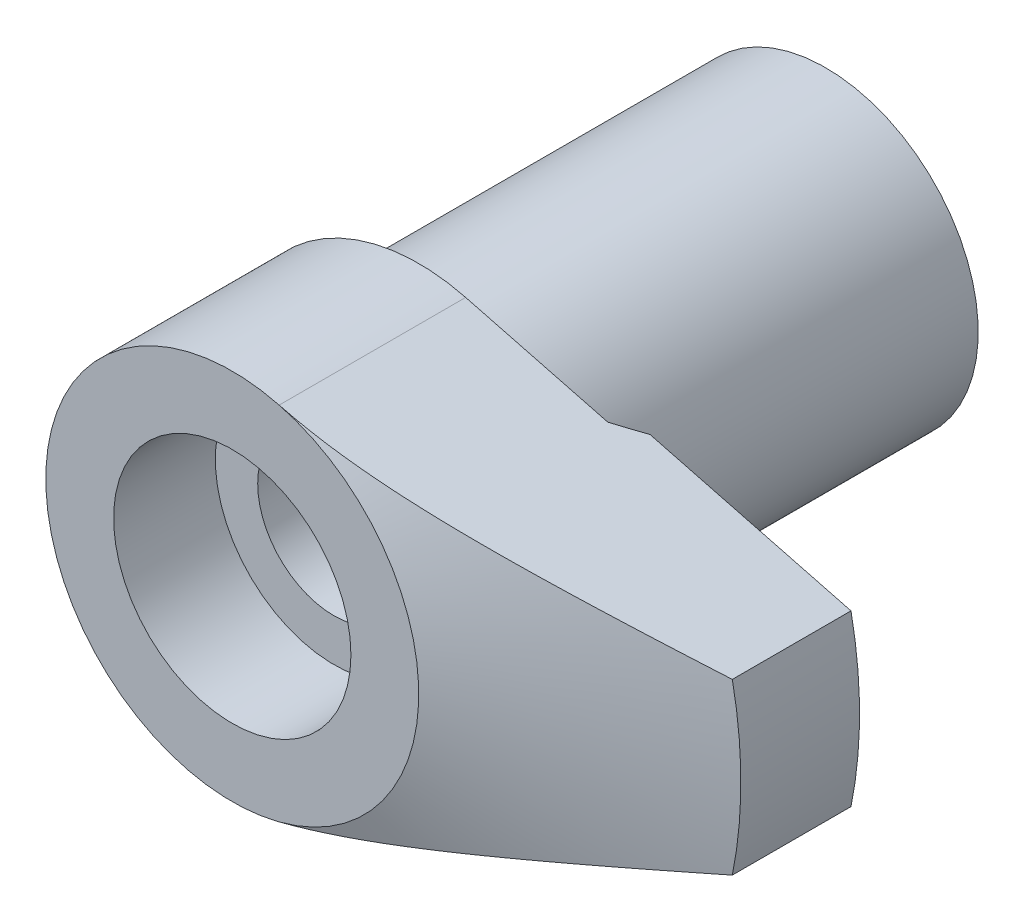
ISO-10303-21;
HEADER;
FILE_DESCRIPTION(('STEP AP214'),'2;1');
FILE_NAME('part.step','',(''),(''),'','','');
FILE_SCHEMA(('AUTOMOTIVE_DESIGN { 1 0 10303 214 1 1 1 1 }'));
ENDSEC;
DATA;
#1=APPLICATION_CONTEXT('core data for automotive mechanical design processes');
#2=APPLICATION_PROTOCOL_DEFINITION('international standard','automotive_design',2000,#1);
#3=PRODUCT_CONTEXT('',#1,'mechanical');
#4=PRODUCT('Part','Part','',(#3));
#5=PRODUCT_RELATED_PRODUCT_CATEGORY('part','',(#4));
#6=PRODUCT_DEFINITION_FORMATION('','',#4);
#7=PRODUCT_DEFINITION_CONTEXT('part definition',#1,'design');
#8=PRODUCT_DEFINITION('design','',#6,#7);
#9=PRODUCT_DEFINITION_SHAPE('','',#8);
#10=(LENGTH_UNIT() NAMED_UNIT(*) SI_UNIT(.MILLI.,.METRE.));
#11=(NAMED_UNIT(*) PLANE_ANGLE_UNIT() SI_UNIT($,.RADIAN.));
#12=(NAMED_UNIT(*) SI_UNIT($,.STERADIAN.) SOLID_ANGLE_UNIT());
#13=UNCERTAINTY_MEASURE_WITH_UNIT(LENGTH_MEASURE(1.E-05),#10,'distance_accuracy_value','');
#14=(GEOMETRIC_REPRESENTATION_CONTEXT(3) GLOBAL_UNCERTAINTY_ASSIGNED_CONTEXT((#13)) GLOBAL_UNIT_ASSIGNED_CONTEXT((#10,
#11,#12)) REPRESENTATION_CONTEXT('',''));
#15=CARTESIAN_POINT('',(0.,0.,0.));
#16=DIRECTION('',(0.,0.,1.));
#17=DIRECTION('',(1.,0.,0.));
#18=AXIS2_PLACEMENT_3D('',#15,#16,#17);
#19=CARTESIAN_POINT('',(24.4948974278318,5.,35.));
#20=DIRECTION('',(-0.25151064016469,-0.967854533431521,0.));
#21=DIRECTION('',(0.967854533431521,-0.25151064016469,0.));
#22=AXIS2_PLACEMENT_3D('',#19,#20,#21);
#23=PLANE('',#22);
#24=DIRECTION('',(0.967854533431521,-0.25151064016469,0.));
#25=VECTOR('',#24,1.);
#26=CARTESIAN_POINT('',(2.76661704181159,10.6463998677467,24.));
#27=LINE('',#26,#25);
#28=CARTESIAN_POINT('',(2.76661704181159,10.6463998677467,24.));
#29=VERTEX_POINT('',#28);
#30=CARTESIAN_POINT('',(11.1484831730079,8.46825383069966,24.));
#31=VERTEX_POINT('',#30);
#32=EDGE_CURVE('E71',#29,#31,#27,.T.);
#33=ORIENTED_EDGE('',*,*,#32,.F.);
#34=DIRECTION('',(0.,0.,-1.));
#35=VECTOR('',#34,1.);
#36=CARTESIAN_POINT('',(2.76661704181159,10.6463998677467,35.));
#37=LINE('',#36,#35);
#38=CARTESIAN_POINT('',(2.76661704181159,10.6463998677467,35.));
#39=VERTEX_POINT('',#38);
#40=EDGE_CURVE('E83',#39,#29,#37,.T.);
#41=ORIENTED_EDGE('',*,*,#40,.F.);
#42=CARTESIAN_POINT('',(24.4950974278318,4.99994802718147,29.9999337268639));
#43=CARTESIAN_POINT('',(24.0522116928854,5.11503812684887,30.1466796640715));
#44=CARTESIAN_POINT('',(23.6090863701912,5.23019048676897,30.2926581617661));
#45=CARTESIAN_POINT('',(22.7222658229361,5.46064330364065,30.5827713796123));
#46=CARTESIAN_POINT('',(22.2785705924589,5.57594376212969,30.7269060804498));
#47=CARTESIAN_POINT('',(21.3906147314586,5.80669160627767,31.0129920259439));
#48=CARTESIAN_POINT('',(20.9463542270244,5.92213895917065,31.1549436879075));
#49=CARTESIAN_POINT('',(20.0570760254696,6.15323043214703,31.4362914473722));
#50=CARTESIAN_POINT('',(19.6120583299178,6.26887455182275,31.5756875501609));
#51=CARTESIAN_POINT('',(18.7232977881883,6.49983150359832,31.8507651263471));
#52=CARTESIAN_POINT('',(18.2795592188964,6.61514322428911,31.9864613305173));
#53=CARTESIAN_POINT('',(17.3910601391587,6.84603223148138,32.2542320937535));
#54=CARTESIAN_POINT('',(16.94629963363,6.96160951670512,32.3863066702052));
#55=CARTESIAN_POINT('',(16.0554166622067,7.1931180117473,32.6461271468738));
#56=CARTESIAN_POINT('',(15.6092937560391,7.30904933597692,32.7738714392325));
#57=CARTESIAN_POINT('',(14.7156449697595,7.54127656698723,33.0240315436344));
#58=CARTESIAN_POINT('',(14.2681190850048,7.65757247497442,33.1464473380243));
#59=CARTESIAN_POINT('',(13.3686258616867,7.89131846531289,33.3855064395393));
#60=CARTESIAN_POINT('',(12.9166482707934,8.0087712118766,33.5021087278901));
#61=CARTESIAN_POINT('',(12.0107954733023,8.2441698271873,33.7271951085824));
#62=CARTESIAN_POINT('',(11.5569202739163,8.3621156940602,33.8356792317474));
#63=CARTESIAN_POINT('',(10.6474365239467,8.59845786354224,34.0425667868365));
#64=CARTESIAN_POINT('',(10.1918298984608,8.71685366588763,34.1409791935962));
#65=CARTESIAN_POINT('',(9.27826891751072,8.954255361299,34.3255960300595));
#66=CARTESIAN_POINT('',(8.82031448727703,9.07326127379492,34.4118000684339));
#67=CARTESIAN_POINT('',(7.8996808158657,9.31250090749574,34.5698254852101));
#68=CARTESIAN_POINT('',(7.4369893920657,9.43273779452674,34.641571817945));
#69=CARTESIAN_POINT('',(6.50937566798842,9.67379129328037,34.7673452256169));
#70=CARTESIAN_POINT('',(6.04445370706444,9.79460781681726,34.8213749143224));
#71=CARTESIAN_POINT('',(5.34500310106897,9.97636991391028,34.8872915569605));
#72=CARTESIAN_POINT('',(5.11113046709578,10.0371450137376,34.9067615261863));
#73=CARTESIAN_POINT('',(4.64302336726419,10.1587892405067,34.9403487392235));
#74=CARTESIAN_POINT('',(4.40878890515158,10.2196583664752,34.9544660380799));
#75=CARTESIAN_POINT('',(3.93993571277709,10.341496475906,34.9771441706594));
#76=CARTESIAN_POINT('',(3.70531684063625,10.4024654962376,34.9857018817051));
#77=CARTESIAN_POINT('',(3.23593856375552,10.5244400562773,34.997138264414));
#78=CARTESIAN_POINT('',(3.00117915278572,10.5854455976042,35.000016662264));
#79=CARTESIAN_POINT('',(2.76641704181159,10.6464518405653,34.9999999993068));
#80=B_SPLINE_CURVE_WITH_KNOTS('',3,(#42,#43,#44,#45,#46,#47,#48,#49,#50,#51,#52,#53,#54,#55,#56,
#57,#58,#59,#60,#61,#62,#63,#64,#65,#66,#67,#68,#69,#70,#71,#72,#73,#74,#75,#76,#77,#78,#79),
.UNSPECIFIED.,.F.,.F.,(4,2,2,2,2,2,2,2,2,2,2,2,2,2,2,2,2,2,4),(0.,1.44165002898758,
2.88331514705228,4.32470116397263,5.76608419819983,7.20048032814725,8.6348695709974,
10.0697857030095,11.5047065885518,12.9486269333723,14.3925417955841,15.8351585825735,
17.277821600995,18.7277903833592,20.1775451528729,20.9047655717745,21.631978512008,
22.3595995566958,23.0872556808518),.UNSPECIFIED.);
#81=CARTESIAN_POINT('',(24.4948974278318,5.,30.));
#82=VERTEX_POINT('',#81);
#83=EDGE_CURVE('E123',#82,#39,#80,.T.);
#84=ORIENTED_EDGE('',*,*,#83,.F.);
#85=DIRECTION('',(0.,0.,-1.));
#86=VECTOR('',#85,1.);
#87=CARTESIAN_POINT('',(24.4948974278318,5.,35.));
#88=LINE('',#87,#86);
#89=CARTESIAN_POINT('',(24.4948974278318,5.,23.));
#90=VERTEX_POINT('',#89);
#91=EDGE_CURVE('E89',#82,#90,#88,.T.);
#92=ORIENTED_EDGE('',*,*,#91,.T.);
#93=DIRECTION('',(-0.967854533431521,0.25151064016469,0.));
#94=VECTOR('',#93,1.);
#95=CARTESIAN_POINT('',(24.4948974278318,5.,23.));
#96=LINE('',#95,#94);
#97=CARTESIAN_POINT('',(12.6368353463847,8.08148454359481,23.));
#98=VERTEX_POINT('',#97);
#99=EDGE_CURVE('E135',#90,#98,#96,.T.);
#100=ORIENTED_EDGE('',*,*,#99,.T.);
#101=CARTESIAN_POINT('',(26.2382325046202,4.54696981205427,11.3706969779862));
#102=CARTESIAN_POINT('',(25.8991823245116,4.63507677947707,11.6897147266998));
#103=CARTESIAN_POINT('',(25.5595716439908,4.72332940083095,12.0080978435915));
#104=CARTESIAN_POINT('',(24.8790691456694,4.90016756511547,12.6434048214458));
#105=CARTESIAN_POINT('',(24.5381773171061,4.98875311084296,12.9603286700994));
#106=CARTESIAN_POINT('',(23.8548820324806,5.16631702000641,13.5925921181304));
#107=CARTESIAN_POINT('',(23.5124782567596,5.25529546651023,13.9079313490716));
#108=CARTESIAN_POINT('',(22.8260407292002,5.43367593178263,14.5367066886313));
#109=CARTESIAN_POINT('',(22.4820069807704,5.52307794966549,14.8501428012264));
#110=CARTESIAN_POINT('',(21.443461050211,5.79295874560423,15.790528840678));
#111=CARTESIAN_POINT('',(20.7461385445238,5.97416782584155,16.4141836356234));
#112=CARTESIAN_POINT('',(19.6928188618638,6.24788778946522,17.3406851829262));
#113=CARTESIAN_POINT('',(19.3405068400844,6.33944103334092,17.6480076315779));
#114=CARTESIAN_POINT('',(18.6330196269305,6.52329155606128,18.2591176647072));
#115=CARTESIAN_POINT('',(18.2778444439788,6.61558883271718,18.562905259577));
#116=CARTESIAN_POINT('',(17.6243853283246,6.78539939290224,19.1153607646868));
#117=CARTESIAN_POINT('',(17.3266162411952,6.86277888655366,19.3646784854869));
#118=CARTESIAN_POINT('',(16.7284511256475,7.01822052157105,19.859925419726));
#119=CARTESIAN_POINT('',(16.428055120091,7.09628265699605,20.1058546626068));
#120=CARTESIAN_POINT('',(15.8241820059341,7.25320759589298,20.5937959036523));
#121=CARTESIAN_POINT('',(15.5207042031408,7.3320705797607,20.8358069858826));
#122=CARTESIAN_POINT('',(14.910279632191,7.49069800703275,21.3151273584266));
#123=CARTESIAN_POINT('',(14.6033328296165,7.57046245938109,21.5524366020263));
#124=CARTESIAN_POINT('',(13.985611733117,7.73098599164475,22.0213074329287));
#125=CARTESIAN_POINT('',(13.6748396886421,7.81174448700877,22.2528721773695));
#126=CARTESIAN_POINT('',(13.0486773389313,7.97446159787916,22.709237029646));
#127=CARTESIAN_POINT('',(12.7332871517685,8.05642018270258,22.9340373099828));
#128=CARTESIAN_POINT('',(12.0972918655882,8.22169252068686,23.3753142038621));
#129=CARTESIAN_POINT('',(11.7766892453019,8.30500562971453,23.5917946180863));
#130=CARTESIAN_POINT('',(11.129246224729,8.47325282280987,24.0146878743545));
#131=CARTESIAN_POINT('',(10.8024050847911,8.55818709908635,24.2210995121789));
#132=CARTESIAN_POINT('',(10.117911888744,8.73606230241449,24.6357554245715));
#133=CARTESIAN_POINT('',(9.75972979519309,8.82914096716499,24.8430719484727));
#134=CARTESIAN_POINT('',(9.03406791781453,9.01771443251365,25.2394227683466));
#135=CARTESIAN_POINT('',(8.66659090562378,9.1132085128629,25.4284624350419));
#136=CARTESIAN_POINT('',(7.9216536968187,9.30679094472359,25.7831080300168));
#137=CARTESIAN_POINT('',(7.54420676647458,9.40487584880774,25.9487434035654));
#138=CARTESIAN_POINT('',(6.77840319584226,9.60388069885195,26.2506267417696));
#139=CARTESIAN_POINT('',(6.39005017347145,9.70479970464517,26.3868843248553));
#140=CARTESIAN_POINT('',(5.6895052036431,9.88684618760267,26.5970144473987));
#141=CARTESIAN_POINT('',(5.37932687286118,9.96745039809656,26.6780161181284));
#142=CARTESIAN_POINT('',(4.75371765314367,10.1300237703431,26.814494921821));
#143=CARTESIAN_POINT('',(4.43828751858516,10.2119927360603,26.8699756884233));
#144=CARTESIAN_POINT('',(3.80502546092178,10.376554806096,26.9525470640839));
#145=CARTESIAN_POINT('',(3.48720563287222,10.4591447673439,26.9797352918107));
#146=CARTESIAN_POINT('',(2.85047359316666,10.6246085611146,27.0045695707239));
#147=CARTESIAN_POINT('',(2.53156140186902,10.7074823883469,27.0022161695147));
#148=CARTESIAN_POINT('',(1.89635384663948,10.8725500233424,26.9681621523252));
#149=CARTESIAN_POINT('',(1.58005322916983,10.9547451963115,26.9365643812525));
#150=CARTESIAN_POINT('',(0.951191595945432,11.118163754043,26.8458635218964));
#151=CARTESIAN_POINT('',(0.638630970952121,11.1993870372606,26.7867575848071));
#152=CARTESIAN_POINT('',(0.0158552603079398,11.3612240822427,26.6431401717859));
#153=CARTESIAN_POINT('',(-0.294306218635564,11.4418239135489,26.5583836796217));
#154=CARTESIAN_POINT('',(-0.908154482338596,11.6013410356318,26.3670987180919));
#155=CARTESIAN_POINT('',(-1.21184206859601,11.6802585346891,26.2605729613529));
#156=CARTESIAN_POINT('',(-1.85174828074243,11.8465471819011,26.0140240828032));
#157=CARTESIAN_POINT('',(-2.18703716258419,11.9336767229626,25.8714433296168));
#158=CARTESIAN_POINT('',(-2.84944117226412,12.1058117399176,25.5671414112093));
#159=CARTESIAN_POINT('',(-3.17655313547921,12.1908163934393,25.4054129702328));
#160=CARTESIAN_POINT('',(-3.82402043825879,12.3590698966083,25.0660746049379));
#161=CARTESIAN_POINT('',(-4.14435525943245,12.4423134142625,24.8884231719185));
#162=CARTESIAN_POINT('',(-4.77813236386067,12.6070093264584,24.5206130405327));
#163=CARTESIAN_POINT('',(-5.09157553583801,12.6884619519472,24.3304559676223));
#164=CARTESIAN_POINT('',(-5.70078766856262,12.84677431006,23.9472912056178));
#165=CARTESIAN_POINT('',(-5.99677846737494,12.9236916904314,23.7546583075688));
#166=CARTESIAN_POINT('',(-6.58388700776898,13.0762601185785,23.3615982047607));
#167=CARTESIAN_POINT('',(-6.87500440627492,13.1519110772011,23.1611704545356));
#168=CARTESIAN_POINT('',(-7.45101169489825,13.3015946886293,22.7552342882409));
#169=CARTESIAN_POINT('',(-7.73593036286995,13.3756348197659,22.5497693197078));
#170=CARTESIAN_POINT('',(-8.30199242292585,13.522734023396,22.1335064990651));
#171=CARTESIAN_POINT('',(-8.58313673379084,13.5957933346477,21.9227099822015));
#172=CARTESIAN_POINT('',(-8.86268598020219,13.6684381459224,21.7097144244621));
#173=B_SPLINE_CURVE_WITH_KNOTS('',3,(#101,#102,#103,#104,#105,#106,#107,#108,#109,#110,#111,
#112,#113,#114,#115,#116,#117,#118,#119,#120,#121,#122,#123,#124,#125,#126,#127,#128,#129,#130,
#131,#132,#133,#134,#135,#136,#137,#138,#139,#140,#141,#142,#143,#144,#145,#146,#147,#148,#149,
#150,#151,#152,#153,#154,#155,#156,#157,#158,#159,#160,#161,#162,#163,#164,#165,#166,#167,#168,
#169,#170,#171,#172),.UNSPECIFIED.,.F.,.F.,(4,2,2,2,2,2,2,2,2,2,2,2,2,2,2,2,2,2,2,2,2,2,2,2,2,2,
2,2,2,2,2,2,2,2,2,4),(0.,1.42141224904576,2.84283646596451,4.26457715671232,5.68631487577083,
8.54493189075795,9.97410235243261,11.4032686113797,12.5912386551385,13.7791983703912,
14.9674318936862,16.1556772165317,17.3432543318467,18.5308011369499,19.7177988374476,
20.9049381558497,22.1771102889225,23.448907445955,24.7190900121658,25.9888560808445,
26.9796391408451,27.9702810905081,28.9574935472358,29.9446877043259,30.9284232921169,
31.9122607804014,32.9058096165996,33.8992347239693,35.022369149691,36.1459317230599,
37.2725135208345,38.398949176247,39.483111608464,40.5673500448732,41.6442669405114,
42.7209167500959),.UNSPECIFIED.);
#174=EDGE_CURVE('E29',#98,#31,#173,.T.);
#175=ORIENTED_EDGE('',*,*,#174,.T.);
#176=EDGE_LOOP('',(#33,#41,#84,#92,#100,#175));
#177=FACE_BOUND('',#176,.T.);
#178=ADVANCED_FACE('F14',(#177),#23,.F.);
#179=CARTESIAN_POINT('',(24.4948974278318,-5.,35.));
#180=DIRECTION('',(0.25151064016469,-0.967854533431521,0.));
#181=DIRECTION('',(0.967854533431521,0.25151064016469,0.));
#182=AXIS2_PLACEMENT_3D('',#179,#180,#181);
#183=PLANE('',#182);
#184=DIRECTION('',(0.,0.,-1.));
#185=VECTOR('',#184,1.);
#186=CARTESIAN_POINT('',(2.76661704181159,-10.6463998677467,35.));
#187=LINE('',#186,#185);
#188=CARTESIAN_POINT('',(2.76661704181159,-10.6463998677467,35.));
#189=VERTEX_POINT('',#188);
#190=CARTESIAN_POINT('',(2.76661704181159,-10.6463998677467,24.));
#191=VERTEX_POINT('',#190);
#192=EDGE_CURVE('E90',#189,#191,#187,.T.);
#193=ORIENTED_EDGE('',*,*,#192,.T.);
#194=DIRECTION('',(-0.967854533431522,-0.251510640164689,0.));
#195=VECTOR('',#194,1.);
#196=CARTESIAN_POINT('',(11.1484831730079,-8.46825383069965,24.));
#197=LINE('',#196,#195);
#198=CARTESIAN_POINT('',(11.1484831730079,-8.46825383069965,24.));
#199=VERTEX_POINT('',#198);
#200=EDGE_CURVE('E73',#199,#191,#197,.T.);
#201=ORIENTED_EDGE('',*,*,#200,.F.);
#202=CARTESIAN_POINT('',(26.2382325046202,-4.54696981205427,11.3706969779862));
#203=CARTESIAN_POINT('',(25.8991823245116,-4.63507677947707,11.6897147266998));
#204=CARTESIAN_POINT('',(25.5595716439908,-4.72332940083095,12.0080978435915));
#205=CARTESIAN_POINT('',(24.8790691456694,-4.90016756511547,12.6434048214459));
#206=CARTESIAN_POINT('',(24.5381773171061,-4.98875311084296,12.9603286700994));
#207=CARTESIAN_POINT('',(23.8548820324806,-5.16631702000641,13.5925921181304));
#208=CARTESIAN_POINT('',(23.5124782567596,-5.25529546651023,13.9079313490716));
#209=CARTESIAN_POINT('',(22.8260407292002,-5.43367593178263,14.5367066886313));
#210=CARTESIAN_POINT('',(22.4820069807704,-5.52307794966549,14.8501428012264));
#211=CARTESIAN_POINT('',(21.443461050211,-5.79295874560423,15.790528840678));
#212=CARTESIAN_POINT('',(20.7461385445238,-5.97416782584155,16.4141836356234));
#213=CARTESIAN_POINT('',(19.6928188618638,-6.24788778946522,17.3406851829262));
#214=CARTESIAN_POINT('',(19.3405068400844,-6.33944103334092,17.6480076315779));
#215=CARTESIAN_POINT('',(18.6330196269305,-6.52329155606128,18.2591176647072));
#216=CARTESIAN_POINT('',(18.2778444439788,-6.61558883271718,18.562905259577));
#217=CARTESIAN_POINT('',(17.6243853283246,-6.78539939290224,19.1153607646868));
#218=CARTESIAN_POINT('',(17.3266162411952,-6.86277888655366,19.3646784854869));
#219=CARTESIAN_POINT('',(16.7284511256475,-7.01822052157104,19.859925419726));
#220=CARTESIAN_POINT('',(16.428055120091,-7.09628265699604,20.1058546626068));
#221=CARTESIAN_POINT('',(15.8241820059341,-7.25320759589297,20.5937959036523));
#222=CARTESIAN_POINT('',(15.5207042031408,-7.33207057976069,20.8358069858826));
#223=CARTESIAN_POINT('',(14.910279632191,-7.49069800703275,21.3151273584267));
#224=CARTESIAN_POINT('',(14.6033328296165,-7.57046245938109,21.5524366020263));
#225=CARTESIAN_POINT('',(13.985611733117,-7.73098599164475,22.0213074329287));
#226=CARTESIAN_POINT('',(13.6748396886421,-7.81174448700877,22.2528721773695));
#227=CARTESIAN_POINT('',(13.0486773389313,-7.97446159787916,22.709237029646));
#228=CARTESIAN_POINT('',(12.7332871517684,-8.05642018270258,22.9340373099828));
#229=CARTESIAN_POINT('',(12.0972918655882,-8.22169252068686,23.3753142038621));
#230=CARTESIAN_POINT('',(11.7766892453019,-8.30500562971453,23.5917946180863));
#231=CARTESIAN_POINT('',(11.1292462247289,-8.47325282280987,24.0146878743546));
#232=CARTESIAN_POINT('',(10.8024050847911,-8.55818709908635,24.2210995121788));
#233=CARTESIAN_POINT('',(10.117911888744,-8.73606230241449,24.6357554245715));
#234=CARTESIAN_POINT('',(9.75972979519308,-8.82914096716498,24.8430719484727));
#235=CARTESIAN_POINT('',(9.03406791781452,-9.01771443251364,25.2394227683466));
#236=CARTESIAN_POINT('',(8.66659090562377,-9.1132085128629,25.4284624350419));
#237=CARTESIAN_POINT('',(7.9216536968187,-9.30679094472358,25.7831080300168));
#238=CARTESIAN_POINT('',(7.54420676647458,-9.40487584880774,25.9487434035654));
#239=CARTESIAN_POINT('',(6.77840319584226,-9.60388069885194,26.2506267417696));
#240=CARTESIAN_POINT('',(6.39005017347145,-9.70479970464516,26.3868843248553));
#241=CARTESIAN_POINT('',(5.6895052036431,-9.88684618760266,26.5970144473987));
#242=CARTESIAN_POINT('',(5.37932687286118,-9.96745039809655,26.6780161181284));
#243=CARTESIAN_POINT('',(4.75371765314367,-10.1300237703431,26.814494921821));
#244=CARTESIAN_POINT('',(4.43828751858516,-10.2119927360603,26.8699756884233));
#245=CARTESIAN_POINT('',(3.80502546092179,-10.376554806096,26.952547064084));
#246=CARTESIAN_POINT('',(3.48720563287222,-10.4591447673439,26.9797352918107));
#247=CARTESIAN_POINT('',(2.85047359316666,-10.6246085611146,27.0045695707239));
#248=CARTESIAN_POINT('',(2.53156140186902,-10.7074823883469,27.0022161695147));
#249=CARTESIAN_POINT('',(1.89635384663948,-10.8725500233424,26.9681621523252));
#250=CARTESIAN_POINT('',(1.58005322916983,-10.9547451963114,26.9365643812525));
#251=CARTESIAN_POINT('',(0.951191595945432,-11.118163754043,26.8458635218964));
#252=CARTESIAN_POINT('',(0.638630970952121,-11.1993870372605,26.7867575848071));
#253=CARTESIAN_POINT('',(0.0158552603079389,-11.3612240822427,26.6431401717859));
#254=CARTESIAN_POINT('',(-0.294306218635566,-11.4418239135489,26.5583836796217));
#255=CARTESIAN_POINT('',(-0.908154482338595,-11.6013410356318,26.3670987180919));
#256=CARTESIAN_POINT('',(-1.211842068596,-11.6802585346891,26.2605729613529));
#257=CARTESIAN_POINT('',(-1.85174828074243,-11.8465471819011,26.0140240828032));
#258=CARTESIAN_POINT('',(-2.18703716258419,-11.9336767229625,25.8714433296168));
#259=CARTESIAN_POINT('',(-2.84944117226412,-12.1058117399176,25.5671414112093));
#260=CARTESIAN_POINT('',(-3.17655313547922,-12.1908163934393,25.4054129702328));
#261=CARTESIAN_POINT('',(-3.8240204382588,-12.3590698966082,25.0660746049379));
#262=CARTESIAN_POINT('',(-4.14435525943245,-12.4423134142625,24.8884231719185));
#263=CARTESIAN_POINT('',(-4.77813236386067,-12.6070093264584,24.5206130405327));
#264=CARTESIAN_POINT('',(-5.09157553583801,-12.6884619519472,24.3304559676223));
#265=CARTESIAN_POINT('',(-5.70078766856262,-12.84677431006,23.9472912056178));
#266=CARTESIAN_POINT('',(-5.99677846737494,-12.9236916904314,23.7546583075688));
#267=CARTESIAN_POINT('',(-6.58388700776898,-13.0762601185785,23.3615982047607));
#268=CARTESIAN_POINT('',(-6.87500440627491,-13.151911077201,23.1611704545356));
#269=CARTESIAN_POINT('',(-7.45101169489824,-13.3015946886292,22.7552342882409));
#270=CARTESIAN_POINT('',(-7.73593036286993,-13.3756348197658,22.5497693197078));
#271=CARTESIAN_POINT('',(-8.30199242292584,-13.522734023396,22.1335064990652));
#272=CARTESIAN_POINT('',(-8.58313673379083,-13.5957933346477,21.9227099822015));
#273=CARTESIAN_POINT('',(-8.86268598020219,-13.6684381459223,21.7097144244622));
#274=B_SPLINE_CURVE_WITH_KNOTS('',3,(#202,#203,#204,#205,#206,#207,#208,#209,#210,#211,#212,
#213,#214,#215,#216,#217,#218,#219,#220,#221,#222,#223,#224,#225,#226,#227,#228,#229,#230,#231,
#232,#233,#234,#235,#236,#237,#238,#239,#240,#241,#242,#243,#244,#245,#246,#247,#248,#249,#250,
#251,#252,#253,#254,#255,#256,#257,#258,#259,#260,#261,#262,#263,#264,#265,#266,#267,#268,#269,
#270,#271,#272,#273),.UNSPECIFIED.,.F.,.F.,(4,2,2,2,2,2,2,2,2,2,2,2,2,2,2,2,2,2,2,2,2,2,2,2,2,2,
2,2,2,2,2,2,2,2,2,4),(0.,1.42141224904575,2.8428364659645,4.26457715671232,5.68631487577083,
8.54493189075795,9.9741023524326,11.4032686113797,12.5912386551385,13.7791983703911,
14.9674318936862,16.1556772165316,17.3432543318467,18.5308011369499,19.7177988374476,
20.9049381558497,22.1771102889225,23.448907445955,24.7190900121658,25.9888560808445,
26.9796391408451,27.9702810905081,28.9574935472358,29.9446877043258,30.9284232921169,
31.9122607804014,32.9058096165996,33.8992347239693,35.022369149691,36.1459317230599,
37.2725135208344,38.3989491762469,39.483111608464,40.5673500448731,41.6442669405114,
42.7209167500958),.UNSPECIFIED.);
#275=CARTESIAN_POINT('',(12.6368353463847,-8.0814845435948,23.));
#276=VERTEX_POINT('',#275);
#277=EDGE_CURVE('E148',#276,#199,#274,.T.);
#278=ORIENTED_EDGE('',*,*,#277,.F.);
#279=DIRECTION('',(-0.967854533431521,-0.25151064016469,0.));
#280=VECTOR('',#279,1.);
#281=CARTESIAN_POINT('',(24.4948974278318,-5.,23.));
#282=LINE('',#281,#280);
#283=CARTESIAN_POINT('',(24.4948974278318,-5.,23.));
#284=VERTEX_POINT('',#283);
#285=EDGE_CURVE('E92',#284,#276,#282,.T.);
#286=ORIENTED_EDGE('',*,*,#285,.F.);
#287=DIRECTION('',(0.,0.,-1.));
#288=VECTOR('',#287,1.);
#289=CARTESIAN_POINT('',(24.4948974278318,-5.,35.));
#290=LINE('',#289,#288);
#291=CARTESIAN_POINT('',(24.4948974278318,-5.,30.));
#292=VERTEX_POINT('',#291);
#293=EDGE_CURVE('E36',#292,#284,#290,.T.);
#294=ORIENTED_EDGE('',*,*,#293,.F.);
#295=CARTESIAN_POINT('',(24.4950974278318,-4.99994802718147,29.9999337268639));
#296=CARTESIAN_POINT('',(24.0522116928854,-5.11503812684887,30.1466796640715));
#297=CARTESIAN_POINT('',(23.6090863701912,-5.23019048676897,30.2926581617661));
#298=CARTESIAN_POINT('',(22.7222658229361,-5.46064330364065,30.5827713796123));
#299=CARTESIAN_POINT('',(22.2785705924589,-5.57594376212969,30.7269060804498));
#300=CARTESIAN_POINT('',(21.3906147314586,-5.80669160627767,31.0129920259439));
#301=CARTESIAN_POINT('',(20.9463542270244,-5.92213895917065,31.1549436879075));
#302=CARTESIAN_POINT('',(20.0570760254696,-6.15323043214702,31.4362914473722));
#303=CARTESIAN_POINT('',(19.6120583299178,-6.26887455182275,31.5756875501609));
#304=CARTESIAN_POINT('',(18.7232977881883,-6.49983150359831,31.8507651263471));
#305=CARTESIAN_POINT('',(18.2795592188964,-6.6151432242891,31.9864613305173));
#306=CARTESIAN_POINT('',(17.3910601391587,-6.84603223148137,32.2542320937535));
#307=CARTESIAN_POINT('',(16.94629963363,-6.96160951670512,32.3863066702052));
#308=CARTESIAN_POINT('',(16.0554166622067,-7.1931180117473,32.6461271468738));
#309=CARTESIAN_POINT('',(15.6092937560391,-7.30904933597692,32.7738714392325));
#310=CARTESIAN_POINT('',(14.7156449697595,-7.54127656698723,33.0240315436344));
#311=CARTESIAN_POINT('',(14.2681190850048,-7.65757247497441,33.1464473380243));
#312=CARTESIAN_POINT('',(13.3686258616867,-7.89131846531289,33.3855064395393));
#313=CARTESIAN_POINT('',(12.9166482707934,-8.0087712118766,33.5021087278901));
#314=CARTESIAN_POINT('',(12.0107954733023,-8.2441698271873,33.7271951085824));
#315=CARTESIAN_POINT('',(11.5569202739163,-8.3621156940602,33.8356792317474));
#316=CARTESIAN_POINT('',(10.6474365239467,-8.59845786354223,34.0425667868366));
#317=CARTESIAN_POINT('',(10.1918298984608,-8.71685366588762,34.1409791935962));
#318=CARTESIAN_POINT('',(9.27826891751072,-8.954255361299,34.3255960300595));
#319=CARTESIAN_POINT('',(8.82031448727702,-9.07326127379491,34.4118000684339));
#320=CARTESIAN_POINT('',(7.8996808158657,-9.31250090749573,34.5698254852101));
#321=CARTESIAN_POINT('',(7.4369893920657,-9.43273779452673,34.641571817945));
#322=CARTESIAN_POINT('',(6.50937566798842,-9.67379129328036,34.7673452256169));
#323=CARTESIAN_POINT('',(6.04445370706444,-9.79460781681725,34.8213749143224));
#324=CARTESIAN_POINT('',(5.34500310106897,-9.97636991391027,34.8872915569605));
#325=CARTESIAN_POINT('',(5.11113046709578,-10.0371450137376,34.9067615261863));
#326=CARTESIAN_POINT('',(4.64302336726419,-10.1587892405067,34.9403487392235));
#327=CARTESIAN_POINT('',(4.40878890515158,-10.2196583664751,34.9544660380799));
#328=CARTESIAN_POINT('',(3.93993571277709,-10.341496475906,34.9771441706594));
#329=CARTESIAN_POINT('',(3.70531684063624,-10.4024654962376,34.9857018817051));
#330=CARTESIAN_POINT('',(3.23593856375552,-10.5244400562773,34.997138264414));
#331=CARTESIAN_POINT('',(3.00117915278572,-10.5854455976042,35.000016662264));
#332=CARTESIAN_POINT('',(2.76641704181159,-10.6464518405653,34.9999999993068));
#333=B_SPLINE_CURVE_WITH_KNOTS('',3,(#295,#296,#297,#298,#299,#300,#301,#302,#303,#304,#305,
#306,#307,#308,#309,#310,#311,#312,#313,#314,#315,#316,#317,#318,#319,#320,#321,#322,#323,#324,
#325,#326,#327,#328,#329,#330,#331,#332),.UNSPECIFIED.,.F.,.F.,(4,2,2,2,2,2,2,2,2,2,2,2,2,2,2,2,
2,2,4),(0.,1.44165002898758,2.88331514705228,4.32470116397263,5.76608419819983,7.20048032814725,
8.6348695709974,10.0697857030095,11.5047065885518,12.9486269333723,14.3925417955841,
15.8351585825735,17.277821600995,18.7277903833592,20.1775451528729,20.9047655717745,
21.631978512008,22.3595995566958,23.0872556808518),.UNSPECIFIED.);
#334=EDGE_CURVE('E22',#292,#189,#333,.T.);
#335=ORIENTED_EDGE('',*,*,#334,.T.);
#336=EDGE_LOOP('',(#193,#201,#278,#286,#294,#335));
#337=FACE_BOUND('',#336,.T.);
#338=ADVANCED_FACE('F108',(#337),#183,.T.);
#339=CARTESIAN_POINT('',(0.,0.,35.));
#340=DIRECTION('',(0.,0.,-1.));
#341=DIRECTION('',(-1.,0.,0.));
#342=AXIS2_PLACEMENT_3D('',#339,#340,#341);
#343=CYLINDRICAL_SURFACE('',#342,11.);
#344=CARTESIAN_POINT('',(0.,0.,24.));
#345=DIRECTION('',(0.,0.,-1.));
#346=DIRECTION('',(-1.,0.,0.));
#347=AXIS2_PLACEMENT_3D('',#344,#345,#346);
#348=CIRCLE('',#347,11.);
#349=EDGE_CURVE('E68',#191,#29,#348,.T.);
#350=ORIENTED_EDGE('',*,*,#349,.F.);
#351=ORIENTED_EDGE('',*,*,#192,.F.);
#352=CARTESIAN_POINT('',(0.,0.,35.));
#353=DIRECTION('',(0.,0.,1.));
#354=DIRECTION('',(1.,0.,0.));
#355=AXIS2_PLACEMENT_3D('',#352,#353,#354);
#356=CIRCLE('',#355,11.);
#357=EDGE_CURVE('E88',#39,#189,#356,.T.);
#358=ORIENTED_EDGE('',*,*,#357,.F.);
#359=ORIENTED_EDGE('',*,*,#40,.T.);
#360=EDGE_LOOP('',(#350,#351,#358,#359));
#361=FACE_BOUND('',#360,.T.);
#362=ADVANCED_FACE('F87',(#361),#343,.T.);
#363=CARTESIAN_POINT('',(0.,0.,35.));
#364=DIRECTION('',(0.,0.,-1.));
#365=DIRECTION('',(-1.,0.,0.));
#366=AXIS2_PLACEMENT_3D('',#363,#364,#365);
#367=CYLINDRICAL_SURFACE('',#366,4.5);
#368=CARTESIAN_POINT('',(0.,0.,29.));
#369=DIRECTION('',(0.,0.,1.));
#370=DIRECTION('',(1.,0.,0.));
#371=AXIS2_PLACEMENT_3D('',#368,#369,#370);
#372=CIRCLE('',#371,4.5);
#373=CARTESIAN_POINT('',(4.5,0.,29.));
#374=VERTEX_POINT('',#373);
#375=EDGE_CURVE('E107',#374,#374,#372,.T.);
#376=ORIENTED_EDGE('',*,*,#375,.T.);
#377=EDGE_LOOP('',(#376));
#378=FACE_BOUND('',#377,.T.);
#379=CARTESIAN_POINT('',(0.,0.,10.));
#380=DIRECTION('',(0.,0.,-1.));
#381=DIRECTION('',(-1.,0.,0.));
#382=AXIS2_PLACEMENT_3D('',#379,#380,#381);
#383=CIRCLE('',#382,4.5);
#384=CARTESIAN_POINT('',(-4.5,0.,10.));
#385=VERTEX_POINT('',#384);
#386=EDGE_CURVE('E160',#385,#385,#383,.T.);
#387=ORIENTED_EDGE('',*,*,#386,.T.);
#388=EDGE_LOOP('',(#387));
#389=FACE_BOUND('',#388,.T.);
#390=ADVANCED_FACE('F213',(#378,#389),#367,.F.);
#391=CARTESIAN_POINT('',(0.,0.,35.));
#392=DIRECTION('',(0.,0.,1.));
#393=DIRECTION('',(1.,0.,0.));
#394=AXIS2_PLACEMENT_3D('',#391,#392,#393);
#395=PLANE('',#394);
#396=CARTESIAN_POINT('',(0.,0.,35.));
#397=DIRECTION('',(0.,0.,1.));
#398=DIRECTION('',(1.,0.,0.));
#399=AXIS2_PLACEMENT_3D('',#396,#397,#398);
#400=CIRCLE('',#399,7.);
#401=CARTESIAN_POINT('',(7.,0.,35.));
#402=VERTEX_POINT('',#401);
#403=EDGE_CURVE('E157',#402,#402,#400,.T.);
#404=ORIENTED_EDGE('',*,*,#403,.F.);
#405=EDGE_LOOP('',(#404));
#406=FACE_BOUND('',#405,.T.);
#407=ORIENTED_EDGE('',*,*,#357,.T.);
#408=CARTESIAN_POINT('',(0.,0.,35.));
#409=DIRECTION('',(0.,0.,1.));
#410=DIRECTION('',(1.,0.,0.));
#411=AXIS2_PLACEMENT_3D('',#408,#409,#410);
#412=CIRCLE('',#411,11.);
#413=EDGE_CURVE('E131',#189,#39,#412,.T.);
#414=ORIENTED_EDGE('',*,*,#413,.T.);
#415=EDGE_LOOP('',(#407,#414));
#416=FACE_BOUND('',#415,.T.);
#417=ADVANCED_FACE('F142',(#406,#416),#395,.T.);
#418=CARTESIAN_POINT('',(0.,0.,35.));
#419=DIRECTION('',(0.,0.,-1.));
#420=DIRECTION('',(-1.,0.,0.));
#421=AXIS2_PLACEMENT_3D('',#418,#419,#420);
#422=CYLINDRICAL_SURFACE('',#421,25.);
#423=CARTESIAN_POINT('',(0.,0.,30.));
#424=DIRECTION('',(0.,0.,1.));
#425=DIRECTION('',(1.,0.,0.));
#426=AXIS2_PLACEMENT_3D('',#423,#424,#425);
#427=CIRCLE('',#426,25.);
#428=EDGE_CURVE('E143',#292,#82,#427,.T.);
#429=ORIENTED_EDGE('',*,*,#428,.F.);
#430=ORIENTED_EDGE('',*,*,#293,.T.);
#431=CARTESIAN_POINT('',(0.,0.,23.));
#432=DIRECTION('',(0.,0.,1.));
#433=DIRECTION('',(1.,0.,0.));
#434=AXIS2_PLACEMENT_3D('',#431,#432,#433);
#435=CIRCLE('',#434,25.);
#436=EDGE_CURVE('E137',#284,#90,#435,.T.);
#437=ORIENTED_EDGE('',*,*,#436,.T.);
#438=ORIENTED_EDGE('',*,*,#91,.F.);
#439=EDGE_LOOP('',(#429,#430,#437,#438));
#440=FACE_BOUND('',#439,.T.);
#441=ADVANCED_FACE('F153',(#440),#422,.T.);
#442=CARTESIAN_POINT('',(0.,0.,0.));
#443=DIRECTION('',(0.,0.,1.));
#444=DIRECTION('',(1.,0.,0.));
#445=AXIS2_PLACEMENT_3D('',#442,#443,#444);
#446=PLANE('',#445);
#447=CARTESIAN_POINT('',(0.,0.,0.));
#448=DIRECTION('',(0.,0.,-1.));
#449=DIRECTION('',(-1.,0.,0.));
#450=AXIS2_PLACEMENT_3D('',#447,#448,#449);
#451=CIRCLE('',#450,5.5);
#452=CARTESIAN_POINT('',(-5.5,0.,0.));
#453=VERTEX_POINT('',#452);
#454=EDGE_CURVE('E163',#453,#453,#451,.T.);
#455=ORIENTED_EDGE('',*,*,#454,.F.);
#456=EDGE_LOOP('',(#455));
#457=FACE_BOUND('',#456,.T.);
#458=CARTESIAN_POINT('',(0.,0.,0.));
#459=DIRECTION('',(0.,0.,-1.));
#460=DIRECTION('',(-1.,0.,0.));
#461=AXIS2_PLACEMENT_3D('',#458,#459,#460);
#462=CIRCLE('',#461,9.);
#463=CARTESIAN_POINT('',(-9.,0.,0.));
#464=VERTEX_POINT('',#463);
#465=EDGE_CURVE('E130',#464,#464,#462,.T.);
#466=ORIENTED_EDGE('',*,*,#465,.T.);
#467=EDGE_LOOP('',(#466));
#468=FACE_BOUND('',#467,.T.);
#469=ADVANCED_FACE('F228',(#457,#468),#446,.F.);
#470=CARTESIAN_POINT('',(30.,20.,23.));
#471=DIRECTION('',(0.,0.,1.));
#472=DIRECTION('',(1.,0.,0.));
#473=AXIS2_PLACEMENT_3D('',#470,#471,#472);
#474=PLANE('',#473);
#475=ORIENTED_EDGE('',*,*,#285,.T.);
#476=CARTESIAN_POINT('',(0.,0.,23.));
#477=DIRECTION('',(0.,0.,1.));
#478=DIRECTION('',(1.,0.,0.));
#479=AXIS2_PLACEMENT_3D('',#476,#477,#478);
#480=CIRCLE('',#479,15.);
#481=EDGE_CURVE('E9',#276,#98,#480,.T.);
#482=ORIENTED_EDGE('',*,*,#481,.T.);
#483=ORIENTED_EDGE('',*,*,#99,.F.);
#484=ORIENTED_EDGE('',*,*,#436,.F.);
#485=EDGE_LOOP('',(#475,#482,#483,#484));
#486=FACE_BOUND('',#485,.T.);
#487=ADVANCED_FACE('F150',(#486),#474,.F.);
#488=CARTESIAN_POINT('',(0.,0.,23.));
#489=DIRECTION('',(0.,0.,-1.));
#490=DIRECTION('',(-1.,0.,0.));
#491=AXIS2_PLACEMENT_3D('',#488,#489,#490);
#492=CYLINDRICAL_SURFACE('',#491,9.);
#493=ORIENTED_EDGE('',*,*,#465,.F.);
#494=EDGE_LOOP('',(#493));
#495=FACE_BOUND('',#494,.T.);
#496=CARTESIAN_POINT('',(0.,0.,24.));
#497=DIRECTION('',(0.,0.,-1.));
#498=DIRECTION('',(-1.,0.,0.));
#499=AXIS2_PLACEMENT_3D('',#496,#497,#498);
#500=CIRCLE('',#499,9.);
#501=CARTESIAN_POINT('',(-9.,0.,24.));
#502=VERTEX_POINT('',#501);
#503=EDGE_CURVE('E78',#502,#502,#500,.T.);
#504=ORIENTED_EDGE('',*,*,#503,.T.);
#505=EDGE_LOOP('',(#504));
#506=FACE_BOUND('',#505,.T.);
#507=ADVANCED_FACE('F117',(#495,#506),#492,.T.);
#508=CARTESIAN_POINT('',(0.,0.,35.));
#509=DIRECTION('',(0.,0.,-1.));
#510=DIRECTION('',(-1.,0.,0.));
#511=AXIS2_PLACEMENT_3D('',#508,#509,#510);
#512=CONICAL_SURFACE('',#511,11.,1.22777238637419);
#513=ORIENTED_EDGE('',*,*,#83,.T.);
#514=ORIENTED_EDGE('',*,*,#413,.F.);
#515=ORIENTED_EDGE('',*,*,#334,.F.);
#516=ORIENTED_EDGE('',*,*,#428,.T.);
#517=EDGE_LOOP('',(#513,#514,#515,#516));
#518=FACE_BOUND('',#517,.T.);
#519=ADVANCED_FACE('F111',(#518),#512,.T.);
#520=CARTESIAN_POINT('',(0.,0.,29.));
#521=DIRECTION('',(0.,0.,1.));
#522=DIRECTION('',(1.,0.,0.));
#523=AXIS2_PLACEMENT_3D('',#520,#521,#522);
#524=CYLINDRICAL_SURFACE('',#523,7.);
#525=CARTESIAN_POINT('',(0.,0.,29.));
#526=DIRECTION('',(0.,0.,1.));
#527=DIRECTION('',(1.,0.,0.));
#528=AXIS2_PLACEMENT_3D('',#525,#526,#527);
#529=CIRCLE('',#528,7.);
#530=CARTESIAN_POINT('',(7.,0.,29.));
#531=VERTEX_POINT('',#530);
#532=EDGE_CURVE('E155',#531,#531,#529,.T.);
#533=ORIENTED_EDGE('',*,*,#532,.F.);
#534=EDGE_LOOP('',(#533));
#535=FACE_BOUND('',#534,.T.);
#536=ORIENTED_EDGE('',*,*,#403,.T.);
#537=EDGE_LOOP('',(#536));
#538=FACE_BOUND('',#537,.T.);
#539=ADVANCED_FACE('F116',(#535,#538),#524,.F.);
#540=CARTESIAN_POINT('',(0.,0.,29.));
#541=DIRECTION('',(0.,0.,1.));
#542=DIRECTION('',(1.,0.,0.));
#543=AXIS2_PLACEMENT_3D('',#540,#541,#542);
#544=PLANE('',#543);
#545=ORIENTED_EDGE('',*,*,#375,.F.);
#546=EDGE_LOOP('',(#545));
#547=FACE_BOUND('',#546,.T.);
#548=ORIENTED_EDGE('',*,*,#532,.T.);
#549=EDGE_LOOP('',(#548));
#550=FACE_BOUND('',#549,.T.);
#551=ADVANCED_FACE('F192',(#547,#550),#544,.T.);
#552=CARTESIAN_POINT('',(0.,0.,10.));
#553=DIRECTION('',(0.,0.,-1.));
#554=DIRECTION('',(-1.,0.,0.));
#555=AXIS2_PLACEMENT_3D('',#552,#553,#554);
#556=CYLINDRICAL_SURFACE('',#555,5.5);
#557=CARTESIAN_POINT('',(0.,0.,10.));
#558=DIRECTION('',(0.,0.,-1.));
#559=DIRECTION('',(-1.,0.,0.));
#560=AXIS2_PLACEMENT_3D('',#557,#558,#559);
#561=CIRCLE('',#560,5.5);
#562=CARTESIAN_POINT('',(-5.5,0.,10.));
#563=VERTEX_POINT('',#562);
#564=EDGE_CURVE('E166',#563,#563,#561,.T.);
#565=ORIENTED_EDGE('',*,*,#564,.F.);
#566=EDGE_LOOP('',(#565));
#567=FACE_BOUND('',#566,.T.);
#568=ORIENTED_EDGE('',*,*,#454,.T.);
#569=EDGE_LOOP('',(#568));
#570=FACE_BOUND('',#569,.T.);
#571=ADVANCED_FACE('F189',(#567,#570),#556,.F.);
#572=CARTESIAN_POINT('',(0.,0.,10.));
#573=DIRECTION('',(0.,0.,-1.));
#574=DIRECTION('',(-1.,0.,0.));
#575=AXIS2_PLACEMENT_3D('',#572,#573,#574);
#576=PLANE('',#575);
#577=ORIENTED_EDGE('',*,*,#386,.F.);
#578=EDGE_LOOP('',(#577));
#579=FACE_BOUND('',#578,.T.);
#580=ORIENTED_EDGE('',*,*,#564,.T.);
#581=EDGE_LOOP('',(#580));
#582=FACE_BOUND('',#581,.T.);
#583=ADVANCED_FACE('F185',(#579,#582),#576,.T.);
#584=CARTESIAN_POINT('',(0.,0.,24.));
#585=DIRECTION('',(0.,0.,-1.));
#586=DIRECTION('',(-1.,0.,0.));
#587=AXIS2_PLACEMENT_3D('',#584,#585,#586);
#588=CONICAL_SURFACE('',#587,14.,0.785398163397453);
#589=ORIENTED_EDGE('',*,*,#481,.F.);
#590=ORIENTED_EDGE('',*,*,#277,.T.);
#591=CARTESIAN_POINT('',(0.,0.,24.));
#592=DIRECTION('',(0.,0.,1.));
#593=DIRECTION('',(1.,0.,0.));
#594=AXIS2_PLACEMENT_3D('',#591,#592,#593);
#595=CIRCLE('',#594,14.);
#596=EDGE_CURVE('E330',#199,#31,#595,.T.);
#597=ORIENTED_EDGE('',*,*,#596,.T.);
#598=ORIENTED_EDGE('',*,*,#174,.F.);
#599=EDGE_LOOP('',(#589,#590,#597,#598));
#600=FACE_BOUND('',#599,.T.);
#601=ADVANCED_FACE('F180',(#600),#588,.F.);
#602=CARTESIAN_POINT('',(0.,0.,24.));
#603=DIRECTION('',(0.,0.,-1.));
#604=DIRECTION('',(-1.,0.,0.));
#605=AXIS2_PLACEMENT_3D('',#602,#603,#604);
#606=PLANE('',#605);
#607=ORIENTED_EDGE('',*,*,#503,.F.);
#608=EDGE_LOOP('',(#607));
#609=FACE_BOUND('',#608,.T.);
#610=ORIENTED_EDGE('',*,*,#349,.T.);
#611=ORIENTED_EDGE('',*,*,#32,.T.);
#612=ORIENTED_EDGE('',*,*,#596,.F.);
#613=ORIENTED_EDGE('',*,*,#200,.T.);
#614=EDGE_LOOP('',(#610,#611,#612,#613));
#615=FACE_BOUND('',#614,.T.);
#616=ADVANCED_FACE('F70',(#609,#615),#606,.T.);
#617=CLOSED_SHELL('',(#178,#338,#362,#390,#417,#441,#469,#487,#507,#519,#539,#551,#571,#583,
#601,#616));
#618=MANIFOLD_SOLID_BREP('B1',#617);
#619=ADVANCED_BREP_SHAPE_REPRESENTATION('',(#18,#618),#14);
#620=SHAPE_DEFINITION_REPRESENTATION(#9,#619);
ENDSEC;
END-ISO-10303-21;
